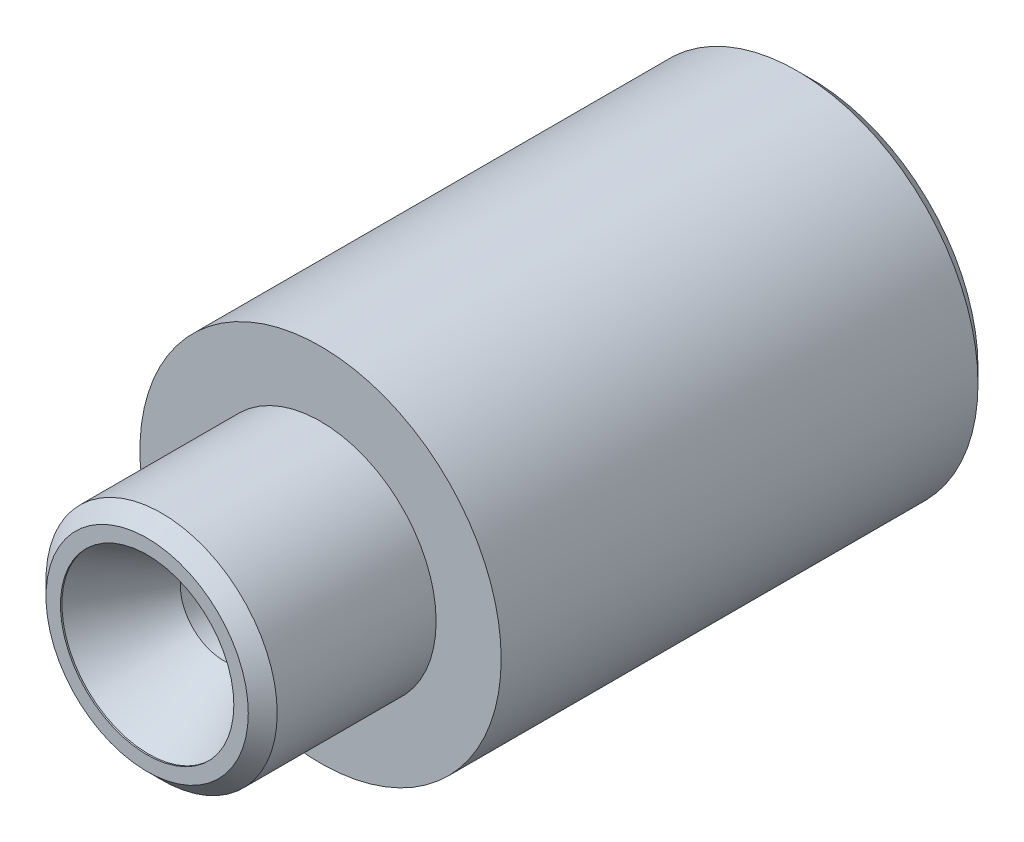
ISO-10303-21;
HEADER;
FILE_DESCRIPTION(('STEP AP214'),'2;1');
FILE_NAME('part.step','',(''),(''),'','','');
FILE_SCHEMA(('AUTOMOTIVE_DESIGN { 1 0 10303 214 1 1 1 1 }'));
ENDSEC;
DATA;
#1=APPLICATION_CONTEXT('core data for automotive mechanical design processes');
#2=APPLICATION_PROTOCOL_DEFINITION('international standard','automotive_design',2000,#1);
#3=PRODUCT_CONTEXT('',#1,'mechanical');
#4=PRODUCT('Part','Part','',(#3));
#5=PRODUCT_RELATED_PRODUCT_CATEGORY('part','',(#4));
#6=PRODUCT_DEFINITION_FORMATION('','',#4);
#7=PRODUCT_DEFINITION_CONTEXT('part definition',#1,'design');
#8=PRODUCT_DEFINITION('design','',#6,#7);
#9=PRODUCT_DEFINITION_SHAPE('','',#8);
#10=(LENGTH_UNIT() NAMED_UNIT(*) SI_UNIT(.MILLI.,.METRE.));
#11=(NAMED_UNIT(*) PLANE_ANGLE_UNIT() SI_UNIT($,.RADIAN.));
#12=(NAMED_UNIT(*) SI_UNIT($,.STERADIAN.) SOLID_ANGLE_UNIT());
#13=UNCERTAINTY_MEASURE_WITH_UNIT(LENGTH_MEASURE(1.E-05),#10,'distance_accuracy_value','');
#14=(GEOMETRIC_REPRESENTATION_CONTEXT(3) GLOBAL_UNCERTAINTY_ASSIGNED_CONTEXT((#13)) GLOBAL_UNIT_ASSIGNED_CONTEXT((#10,
#11,#12)) REPRESENTATION_CONTEXT('',''));
#15=CARTESIAN_POINT('',(0.,0.,0.));
#16=DIRECTION('',(0.,0.,1.));
#17=DIRECTION('',(1.,0.,0.));
#18=AXIS2_PLACEMENT_3D('',#15,#16,#17);
#19=CARTESIAN_POINT('',(0.,0.,23.));
#20=DIRECTION('',(0.,0.,1.));
#21=DIRECTION('',(1.,0.,0.));
#22=AXIS2_PLACEMENT_3D('',#19,#20,#21);
#23=PLANE('',#22);
#24=CARTESIAN_POINT('',(0.,0.,23.));
#25=DIRECTION('',(0.,0.,1.));
#26=DIRECTION('',(1.,0.,0.));
#27=AXIS2_PLACEMENT_3D('',#24,#25,#26);
#28=CIRCLE('',#27,3.49999999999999);
#29=CARTESIAN_POINT('',(3.50000000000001,0.,23.));
#30=VERTEX_POINT('',#29);
#31=EDGE_CURVE('E43',#30,#30,#28,.T.);
#32=ORIENTED_EDGE('',*,*,#31,.T.);
#33=EDGE_LOOP('',(#32));
#34=FACE_BOUND('',#33,.T.);
#35=CARTESIAN_POINT('',(0.,0.,23.));
#36=DIRECTION('',(0.,0.,1.));
#37=DIRECTION('',(1.,0.,0.));
#38=AXIS2_PLACEMENT_3D('',#35,#36,#37);
#39=CIRCLE('',#38,3.);
#40=CARTESIAN_POINT('',(3.00000000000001,0.,23.));
#41=VERTEX_POINT('',#40);
#42=EDGE_CURVE('E142',#41,#41,#39,.T.);
#43=ORIENTED_EDGE('',*,*,#42,.F.);
#44=EDGE_LOOP('',(#43));
#45=FACE_BOUND('',#44,.T.);
#46=ADVANCED_FACE('F35',(#34,#45),#23,.T.);
#47=CARTESIAN_POINT('',(0.,0.,0.));
#48=DIRECTION('',(0.,0.,1.));
#49=DIRECTION('',(1.,0.,0.));
#50=AXIS2_PLACEMENT_3D('',#47,#48,#49);
#51=PLANE('',#50);
#52=CARTESIAN_POINT('',(0.,0.,0.));
#53=DIRECTION('',(0.,0.,1.));
#54=DIRECTION('',(1.,0.,0.));
#55=AXIS2_PLACEMENT_3D('',#52,#53,#54);
#56=CIRCLE('',#55,5.75);
#57=CARTESIAN_POINT('',(5.75,0.,0.));
#58=VERTEX_POINT('',#57);
#59=EDGE_CURVE('E104',#58,#58,#56,.F.);
#60=ORIENTED_EDGE('',*,*,#59,.T.);
#61=EDGE_LOOP('',(#60));
#62=FACE_BOUND('',#61,.T.);
#63=CARTESIAN_POINT('',(0.,0.,0.));
#64=DIRECTION('',(0.,0.,-1.));
#65=DIRECTION('',(-1.,0.,0.));
#66=AXIS2_PLACEMENT_3D('',#63,#64,#65);
#67=CIRCLE('',#66,1.75);
#68=CARTESIAN_POINT('',(-1.75,0.,0.));
#69=VERTEX_POINT('',#68);
#70=EDGE_CURVE('E99',#69,#69,#67,.T.);
#71=ORIENTED_EDGE('',*,*,#70,.F.);
#72=EDGE_LOOP('',(#71));
#73=FACE_BOUND('',#72,.T.);
#74=ADVANCED_FACE('F62',(#62,#73),#51,.F.);
#75=CARTESIAN_POINT('',(0.,0.,17.));
#76=DIRECTION('',(0.,0.,-1.));
#77=DIRECTION('',(-1.,0.,0.));
#78=AXIS2_PLACEMENT_3D('',#75,#76,#77);
#79=CYLINDRICAL_SURFACE('',#78,6.25);
#80=CARTESIAN_POINT('',(0.,0.,0.500000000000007));
#81=DIRECTION('',(0.,0.,1.));
#82=DIRECTION('',(1.,0.,0.));
#83=AXIS2_PLACEMENT_3D('',#80,#81,#82);
#84=CIRCLE('',#83,6.25);
#85=CARTESIAN_POINT('',(6.25,0.,0.500000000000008));
#86=VERTEX_POINT('',#85);
#87=EDGE_CURVE('E96',#86,#86,#84,.T.);
#88=ORIENTED_EDGE('',*,*,#87,.T.);
#89=EDGE_LOOP('',(#88));
#90=FACE_BOUND('',#89,.T.);
#91=CARTESIAN_POINT('',(0.,0.,17.));
#92=DIRECTION('',(0.,0.,1.));
#93=DIRECTION('',(1.,0.,0.));
#94=AXIS2_PLACEMENT_3D('',#91,#92,#93);
#95=CIRCLE('',#94,6.25);
#96=CARTESIAN_POINT('',(6.25000000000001,0.,17.));
#97=VERTEX_POINT('',#96);
#98=EDGE_CURVE('E92',#97,#97,#95,.T.);
#99=ORIENTED_EDGE('',*,*,#98,.F.);
#100=EDGE_LOOP('',(#99));
#101=FACE_BOUND('',#100,.T.);
#102=ADVANCED_FACE('F37',(#90,#101),#79,.T.);
#103=CARTESIAN_POINT('',(0.,0.,17.));
#104=DIRECTION('',(0.,0.,1.));
#105=DIRECTION('',(1.,0.,0.));
#106=AXIS2_PLACEMENT_3D('',#103,#104,#105);
#107=PLANE('',#106);
#108=CARTESIAN_POINT('',(0.,0.,17.));
#109=DIRECTION('',(0.,0.,1.));
#110=DIRECTION('',(1.,0.,0.));
#111=AXIS2_PLACEMENT_3D('',#108,#109,#110);
#112=CIRCLE('',#111,4.);
#113=CARTESIAN_POINT('',(4.00000000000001,0.,17.));
#114=VERTEX_POINT('',#113);
#115=EDGE_CURVE('E89',#114,#114,#112,.T.);
#116=ORIENTED_EDGE('',*,*,#115,.F.);
#117=EDGE_LOOP('',(#116));
#118=FACE_BOUND('',#117,.T.);
#119=ORIENTED_EDGE('',*,*,#98,.T.);
#120=EDGE_LOOP('',(#119));
#121=FACE_BOUND('',#120,.T.);
#122=ADVANCED_FACE('F78',(#118,#121),#107,.T.);
#123=CARTESIAN_POINT('',(0.,0.,23.));
#124=DIRECTION('',(0.,0.,-1.));
#125=DIRECTION('',(-1.,0.,0.));
#126=AXIS2_PLACEMENT_3D('',#123,#124,#125);
#127=CYLINDRICAL_SURFACE('',#126,4.);
#128=CARTESIAN_POINT('',(0.,0.,22.5));
#129=DIRECTION('',(0.,0.,1.));
#130=DIRECTION('',(1.,0.,0.));
#131=AXIS2_PLACEMENT_3D('',#128,#129,#130);
#132=CIRCLE('',#131,4.);
#133=CARTESIAN_POINT('',(4.00000000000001,0.,22.5));
#134=VERTEX_POINT('',#133);
#135=EDGE_CURVE('E11',#134,#134,#132,.F.);
#136=ORIENTED_EDGE('',*,*,#135,.T.);
#137=EDGE_LOOP('',(#136));
#138=FACE_BOUND('',#137,.T.);
#139=ORIENTED_EDGE('',*,*,#115,.T.);
#140=EDGE_LOOP('',(#139));
#141=FACE_BOUND('',#140,.T.);
#142=ADVANCED_FACE('F76',(#138,#141),#127,.T.);
#143=CARTESIAN_POINT('',(0.,0.,0.500000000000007));
#144=DIRECTION('',(0.,0.,1.));
#145=DIRECTION('',(1.,0.,0.));
#146=AXIS2_PLACEMENT_3D('',#143,#144,#145);
#147=CONICAL_SURFACE('',#146,6.25,0.785398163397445);
#148=ORIENTED_EDGE('',*,*,#59,.F.);
#149=EDGE_LOOP('',(#148));
#150=FACE_BOUND('',#149,.T.);
#151=ORIENTED_EDGE('',*,*,#87,.F.);
#152=EDGE_LOOP('',(#151));
#153=FACE_BOUND('',#152,.T.);
#154=ADVANCED_FACE('F74',(#150,#153),#147,.T.);
#155=CARTESIAN_POINT('',(0.,0.,23.));
#156=DIRECTION('',(0.,0.,-1.));
#157=DIRECTION('',(-1.,0.,0.));
#158=AXIS2_PLACEMENT_3D('',#155,#156,#157);
#159=CONICAL_SURFACE('',#158,3.49999999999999,0.785398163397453);
#160=ORIENTED_EDGE('',*,*,#135,.F.);
#161=EDGE_LOOP('',(#160));
#162=FACE_BOUND('',#161,.T.);
#163=ORIENTED_EDGE('',*,*,#31,.F.);
#164=EDGE_LOOP('',(#163));
#165=FACE_BOUND('',#164,.T.);
#166=ADVANCED_FACE('F108',(#162,#165),#159,.T.);
#167=CARTESIAN_POINT('',(0.,0.,13.5515060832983));
#168=DIRECTION('',(0.,0.,-1.));
#169=DIRECTION('',(-1.,0.,0.));
#170=AXIS2_PLACEMENT_3D('',#167,#168,#169);
#171=CONICAL_SURFACE('',#170,0.,1.02974425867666);
#172=CARTESIAN_POINT('',(0.,0.,12.5));
#173=DIRECTION('',(0.,0.,-1.));
#174=DIRECTION('',(-1.,0.,0.));
#175=AXIS2_PLACEMENT_3D('',#172,#173,#174);
#176=CIRCLE('',#175,1.75);
#177=CARTESIAN_POINT('',(-1.75,0.,12.5));
#178=VERTEX_POINT('',#177);
#179=EDGE_CURVE('E94',#178,#178,#176,.T.);
#180=ORIENTED_EDGE('',*,*,#179,.T.);
#181=EDGE_LOOP('',(#180));
#182=FACE_BOUND('',#181,.T.);
#183=CARTESIAN_POINT('',(0.,0.,13.5515060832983));
#184=VERTEX_POINT('',#183);
#185=VERTEX_LOOP('',#184);
#186=FACE_BOUND('',#185,.T.);
#187=ADVANCED_FACE('F110',(#182,#186),#171,.F.);
#188=CARTESIAN_POINT('',(0.,0.,0.));
#189=DIRECTION('',(0.,0.,-1.));
#190=DIRECTION('',(-1.,0.,0.));
#191=AXIS2_PLACEMENT_3D('',#188,#189,#190);
#192=CYLINDRICAL_SURFACE('',#191,1.75);
#193=ORIENTED_EDGE('',*,*,#70,.T.);
#194=EDGE_LOOP('',(#193));
#195=FACE_BOUND('',#194,.T.);
#196=ORIENTED_EDGE('',*,*,#179,.F.);
#197=EDGE_LOOP('',(#196));
#198=FACE_BOUND('',#197,.T.);
#199=ADVANCED_FACE('F116',(#195,#198),#192,.F.);
#200=CARTESIAN_POINT('',(0.,0.,23.));
#201=DIRECTION('',(0.,0.,1.));
#202=DIRECTION('',(1.,0.,0.));
#203=AXIS2_PLACEMENT_3D('',#200,#201,#202);
#204=CYLINDRICAL_SURFACE('',#203,3.);
#205=ORIENTED_EDGE('',*,*,#42,.T.);
#206=EDGE_LOOP('',(#205));
#207=FACE_BOUND('',#206,.T.);
#208=CARTESIAN_POINT('',(0.,0.,22.95));
#209=DIRECTION('',(0.,0.,1.));
#210=DIRECTION('',(1.,0.,0.));
#211=AXIS2_PLACEMENT_3D('',#208,#209,#210);
#212=CIRCLE('',#211,3.);
#213=CARTESIAN_POINT('',(3.00000000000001,0.,22.95));
#214=VERTEX_POINT('',#213);
#215=EDGE_CURVE('E136',#214,#214,#212,.T.);
#216=ORIENTED_EDGE('',*,*,#215,.F.);
#217=EDGE_LOOP('',(#216));
#218=FACE_BOUND('',#217,.T.);
#219=ADVANCED_FACE('F124',(#207,#218),#204,.F.);
#220=CARTESIAN_POINT('',(0.,0.,20.3519237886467));
#221=DIRECTION('',(0.,0.,1.));
#222=DIRECTION('',(1.,0.,0.));
#223=AXIS2_PLACEMENT_3D('',#220,#221,#222);
#224=CONICAL_SURFACE('',#223,1.5,0.5235987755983);
#225=ORIENTED_EDGE('',*,*,#215,.T.);
#226=EDGE_LOOP('',(#225));
#227=FACE_BOUND('',#226,.T.);
#228=CARTESIAN_POINT('',(0.,0.,20.3519237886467));
#229=DIRECTION('',(0.,0.,1.));
#230=DIRECTION('',(1.,0.,0.));
#231=AXIS2_PLACEMENT_3D('',#228,#229,#230);
#232=CIRCLE('',#231,1.5);
#233=CARTESIAN_POINT('',(1.5,0.,20.3519237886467));
#234=VERTEX_POINT('',#233);
#235=EDGE_CURVE('E139',#234,#234,#232,.T.);
#236=ORIENTED_EDGE('',*,*,#235,.F.);
#237=EDGE_LOOP('',(#236));
#238=FACE_BOUND('',#237,.T.);
#239=ADVANCED_FACE('F57',(#227,#238),#224,.F.);
#240=CARTESIAN_POINT('',(0.,0.,23.));
#241=DIRECTION('',(0.,0.,1.));
#242=DIRECTION('',(1.,0.,0.));
#243=AXIS2_PLACEMENT_3D('',#240,#241,#242);
#244=CYLINDRICAL_SURFACE('',#243,1.5);
#245=ORIENTED_EDGE('',*,*,#235,.T.);
#246=EDGE_LOOP('',(#245));
#247=FACE_BOUND('',#246,.T.);
#248=CARTESIAN_POINT('',(0.,0.,18.5));
#249=DIRECTION('',(0.,0.,1.));
#250=DIRECTION('',(1.,0.,0.));
#251=AXIS2_PLACEMENT_3D('',#248,#249,#250);
#252=CIRCLE('',#251,1.5);
#253=CARTESIAN_POINT('',(1.5,0.,18.5));
#254=VERTEX_POINT('',#253);
#255=EDGE_CURVE('E140',#254,#254,#252,.T.);
#256=ORIENTED_EDGE('',*,*,#255,.F.);
#257=EDGE_LOOP('',(#256));
#258=FACE_BOUND('',#257,.T.);
#259=ADVANCED_FACE('F51',(#247,#258),#244,.F.);
#260=CARTESIAN_POINT('',(0.,0.,17.6339745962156));
#261=DIRECTION('',(0.,0.,1.));
#262=DIRECTION('',(1.,0.,0.));
#263=AXIS2_PLACEMENT_3D('',#260,#261,#262);
#264=CONICAL_SURFACE('',#263,0.,1.0471975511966);
#265=ORIENTED_EDGE('',*,*,#255,.T.);
#266=EDGE_LOOP('',(#265));
#267=FACE_BOUND('',#266,.T.);
#268=CARTESIAN_POINT('',(0.,0.,17.6339745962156));
#269=VERTEX_POINT('',#268);
#270=VERTEX_LOOP('',#269);
#271=FACE_BOUND('',#270,.T.);
#272=ADVANCED_FACE('F49',(#267,#271),#264,.F.);
#273=CLOSED_SHELL('',(#46,#74,#102,#122,#142,#154,#166,#187,#199,#219,#239,#259,#272));
#274=MANIFOLD_SOLID_BREP('B2',#273);
#275=ADVANCED_BREP_SHAPE_REPRESENTATION('',(#18,#274),#14);
#276=SHAPE_DEFINITION_REPRESENTATION(#9,#275);
ENDSEC;
END-ISO-10303-21;
